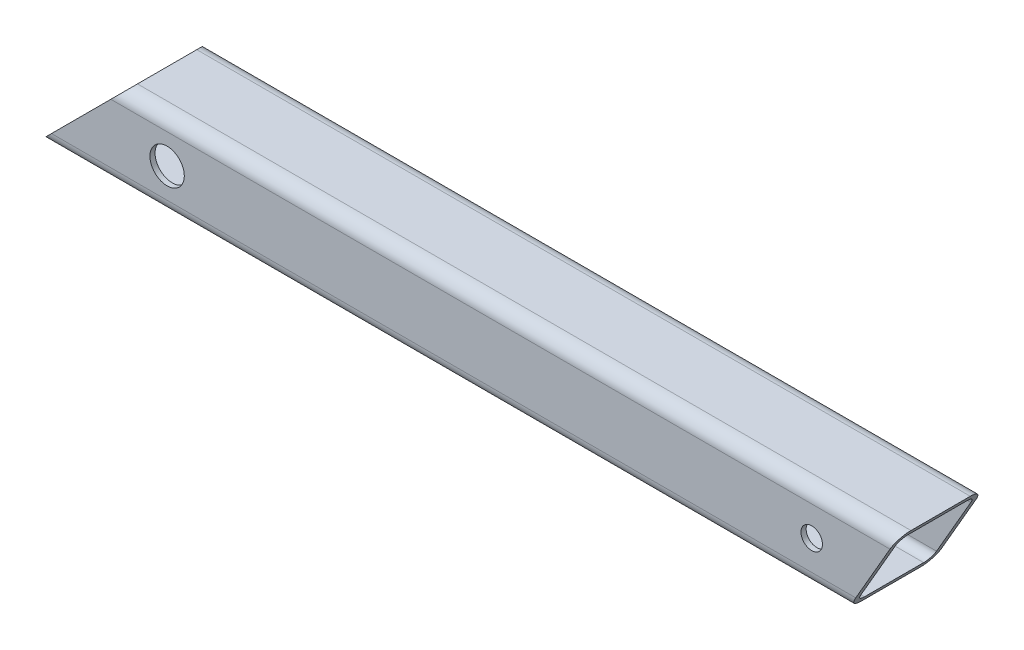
from build123d import *

# Parameters (mm, degrees)
STRUCTURAL_MEMBER1_DEPTH = 1000
CUT_EXTRUDE2_DEPTH       = 1003.496882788
CUT_EXTRUDE2_DEPTH_BACK  = 1003.496882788
CUT_EXTRUDE5_DEPTH       = 1003.496882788
CUT_EXTRUDE5_DEPTH_BACK  = 1003.496882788
SKETCH15_R               = 20
SKETCH15_R_2             = 12.5
CUT_EXTRUDE6_DEPTH       = 1007.230589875


with BuildPart() as part:
    # Sketch12 → Structural Member1 (new body)
    with BuildSketch(Plane(origin=(0, 0, 0), x_dir=(0, 0, -1), z_dir=(1, 0, 0))):
        with BuildLine():
            Line((-34.5, 50), (34.5, 50))
            ThreePointArc((34.5, 50), (45.460155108, 45.460155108), (50, 34.5))
            Line((50, 34.5), (50, -34.5))
            ThreePointArc((50, -34.5), (45.460155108, -45.460155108), (34.5, -50))
            Line((34.5, -50), (-34.5, -50))
            ThreePointArc((-34.5, -50), (-45.460155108, -45.460155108), (-50, -34.5))
            Line((-50, -34.5), (-50, 34.5))
            ThreePointArc((-50, 34.5), (-45.460155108, 45.460155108), (-34.5, 50))
        make_face()
        with BuildLine():
            Line((-34.5, 44), (34.5, 44))
            ThreePointArc((34.5, 44), (41.217514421, 41.217514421), (44, 34.5))
            Line((44, 34.5), (44, -34.5))
            ThreePointArc((44, -34.5), (41.217514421, -41.217514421), (34.5, -44))
            Line((34.5, -44), (-34.5, -44))
            ThreePointArc((-34.5, -44), (-41.217514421, -41.217514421), (-44, -34.5))
            Line((-44, -34.5), (-44, 34.5))
            ThreePointArc((-44, 34.5), (-41.217514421, 41.217514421), (-34.5, 44))
        make_face(mode=Mode.SUBTRACT)
    extrude(amount=STRUCTURAL_MEMBER1_DEPTH)

    # Sketch13 → Cut-Extrude2 (cut, two sides: drawn at the far end of the back side and taken through both)
    with BuildSketch(Plane.XY.offset(-CUT_EXTRUDE2_DEPTH_BACK)):
        Polygon((-1428.338108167, -1478.338108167), (0, -50), (100, 50), (1528.338108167, 1478.338108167), (-1328.338108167, 4335.014324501), (-4285.014324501, 1378.338108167), align=None)
    extrude(amount=CUT_EXTRUDE2_DEPTH + CUT_EXTRUDE2_DEPTH_BACK, mode=Mode.SUBTRACT)

    # Sketch14 → Cut-Extrude5 (cut, two sides: drawn at the far end of the back side and taken through both)
    with BuildSketch(Plane.XY.offset(-CUT_EXTRUDE5_DEPTH_BACK)):
        Polygon((2009.987562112, 1799.349772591), (1000, 50), (942.264973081, -50), (-67.722589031, -1799.349772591), (3430.97695615, -3819.324896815), (5508.687107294, -220.625351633), align=None)
    extrude(amount=CUT_EXTRUDE5_DEPTH + CUT_EXTRUDE5_DEPTH_BACK, mode=Mode.SUBTRACT)

    # Sketch15 → Cut-Extrude6 (cut, through all)
    with BuildSketch(Plane.XY.offset(50)):
        with Locations((150, 0)):
            Circle(SKETCH15_R)
        with Locations((900, 0)):
            Circle(SKETCH15_R_2)
    extrude(amount=-CUT_EXTRUDE6_DEPTH, mode=Mode.SUBTRACT)


solid = part.part
